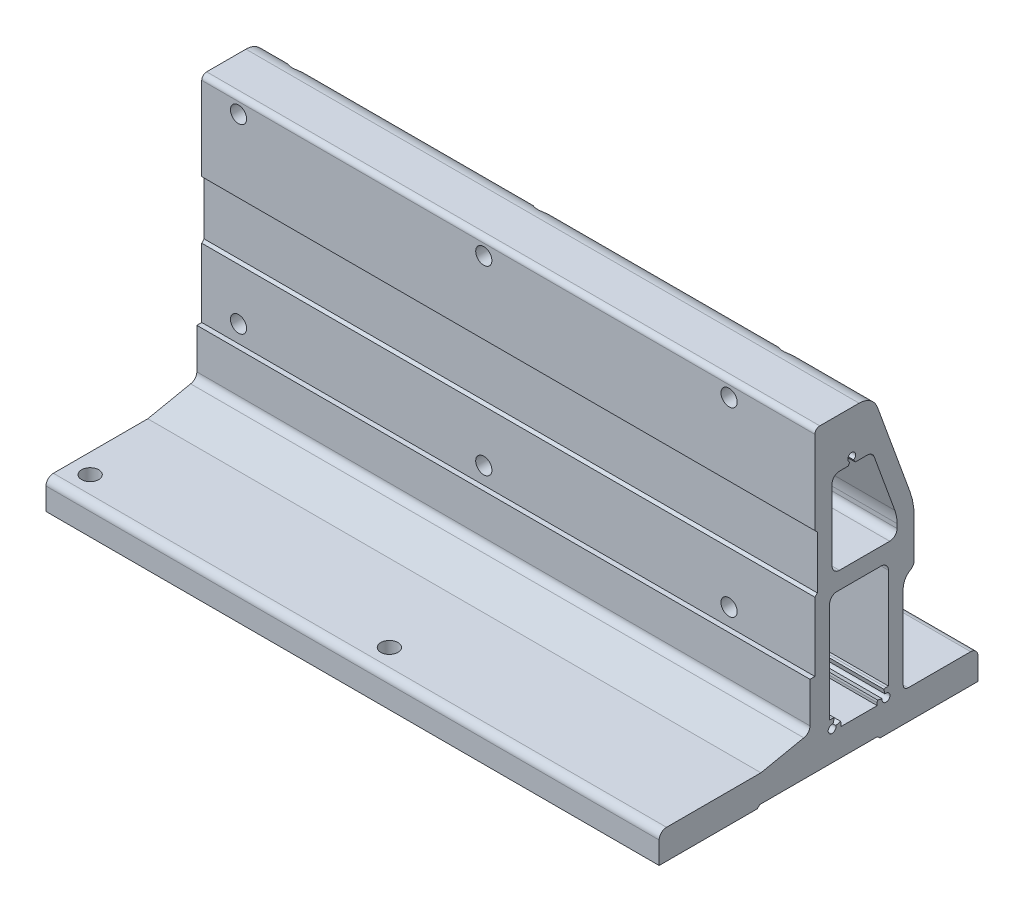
from build123d import *

# Parameters (mm, degrees)
EXTRUDE_1_DEPTH              = 125
HOLE_WIZARD_M6_1_D           = 6.6
HOLE_WIZARD_M6_1_CBORE_D     = 11
HOLE_WIZARD_M6_1_CBORE_DEPTH = 34.5
PATTERN_LINEAR_1_COUNT       = 3
PATTERN_LINEAR_1_PITCH       = 100
HOLE_WIZARD_M4_1_D           = 3.3
HOLE_WIZARD_M4_1_DEPTH       = 10
HOLE_WIZARD_M4_1_TIP         = 0.991420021
F_5_0MM_1_D                  = 5
F_5_0MM_1_DEPTH              = 10
F_5_0MM_1_TIP                = 1.502151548
HOLE_WIZARD_7_0_7_1_D        = 7


with BuildPart() as part:
    # Sketch 1 → Extrude 1 (new, symmetric)
    with BuildSketch(Plane(origin=(0, 0, 0), x_dir=(0, 0, -1), z_dir=(1, 0, 0))):
        with BuildLine():
            Line((-1.5, 85.5), (-1.5, 119.5))
            ThreePointArc((-1.5, 119.5), (-0.914213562, 120.914213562), (0.5, 121.5))
            Line((0.5, 121.5), (16.514163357, 121.5))
            ThreePointArc((16.514163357, 121.5), (21.102774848, 120.053216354), (24.031704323, 116.236161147))
            Line((24.031704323, 116.236161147), (37.190778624, 80.081901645))
            ThreePointArc((37.190778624, 80.081901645), (38.54423259, 75.030742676), (39, 69.821297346))
            Line((39, 69.821297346), (39, 54.794228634))
            ThreePointArc((39, 54.794228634), (38.598076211, 53.294228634), (37.5, 52.196152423))
            ThreePointArc((37.5, 52.196152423), (35.303847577, 50), (34.5, 47))
            Line((34.5, 47), (34.5, 13))
            ThreePointArc((34.5, 13), (35.085786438, 11.585786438), (36.5, 11))
            Line((36.5, 11), (62, 11))
            ThreePointArc((62, 11), (64.121320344, 10.121320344), (65, 8))
            Line((65, 8), (65, -1))
            Line((65, -1), (25, -1))
            Line((25, -1), (24, 0))
            Line((24, 0), (-24, 0))
            Line((-24, 0), (-25, -1))
            Line((-25, -1), (-65, -1))
            Line((-65, -1), (-65, 8))
            ThreePointArc((-65, 8), (-64.121320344, 10.121320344), (-62, 11))
            Line((-62, 11), (-23.5, 11))
            Line((-23.5, 11), (-6.035096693, 14.602337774))
            ThreePointArc((-6.035096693, 14.602337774), (-4.220229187, 15.616059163), (-3.5, 17.566096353))
            Line((-3.5, 17.566096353), (-3.5, 34))
            Line((-3.5, 34), (-1.5, 34))
            Line((-1.5, 34), (-1.5, 62))
            Line((-1.5, 62), (-0.5, 63))
            Line((-0.5, 63), (-0.5, 84.5))
            Line((-0.5, 84.5), (-1.5, 85.5))
        make_face()
        with BuildLine():
            Line((22.664439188, 99.52606043), (31.095389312, 76.362215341))
            ThreePointArc((31.095389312, 76.362215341), (31.772116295, 73.836635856), (32, 71.231913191))
            Line((32, 71.231913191), (32, 69.5))
            ThreePointArc((32, 69.5), (31.121320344, 67.378679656), (29, 66.5))
            Line((29, 66.5), (8.5, 66.5))
            ThreePointArc((8.5, 66.5), (6.378679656, 67.378679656), (5.5, 69.5))
            Line((5.5, 69.5), (5.5, 98.5))
            ThreePointArc((5.5, 98.5), (6.378679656, 100.621320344), (8.5, 101.5))
            Line((8.5, 101.5), (12.056626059, 101.5))
            Line((12.056626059, 101.5), (12.7, 102.614356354))
            ThreePointArc((12.7, 102.614356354), (13.5, 105.599997), (14.3, 102.614356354))
            Line((14.3, 102.614356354), (14.943373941, 101.5))
            Line((14.943373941, 101.5), (19.845361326, 101.5))
            ThreePointArc((19.845361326, 101.5), (21.566090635, 100.957456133), (22.664439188, 99.52606043))
        make_face(mode=Mode.SUBTRACT)
        with BuildLine():
            Line((28.5, 15.6), (28.5, 56.5))
            ThreePointArc((28.5, 56.5), (27.621320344, 58.621320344), (25.5, 59.5))
            Line((25.5, 59.5), (7.5, 59.5))
            ThreePointArc((7.5, 59.5), (5.378679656, 58.621320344), (4.5, 56.5))
            Line((4.5, 56.5), (4.5, 15.6))
            Line((4.5, 15.6), (5.5, 15.6))
            ThreePointArc((5.5, 15.6), (5.969894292, 15.569201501), (6.431748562, 15.477332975))
            Line((6.431748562, 15.477332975), (5.914110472, 13.545481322))
            ThreePointArc((5.914110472, 13.545481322), (4.36862915, 10.86862915), (7.045481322, 12.414110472))
            Line((7.045481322, 12.414110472), (8.977332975, 12.931748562))
            ThreePointArc((8.977332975, 12.931748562), (9.069201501, 12.469894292), (9.1, 12))
            Line((9.1, 12), (9.1, 11))
            Line((9.1, 11), (23.9, 11))
            Line((23.9, 11), (23.9, 12))
            ThreePointArc((23.9, 12), (23.930798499, 12.469894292), (24.022667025, 12.931748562))
            Line((24.022667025, 12.931748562), (25.954518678, 12.414110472))
            ThreePointArc((25.954518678, 12.414110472), (28.63137085, 10.86862915), (27.085889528, 13.545481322))
            Line((27.085889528, 13.545481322), (26.568251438, 15.477332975))
            ThreePointArc((26.568251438, 15.477332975), (27.030105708, 15.569201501), (27.5, 15.6))
            Line((27.5, 15.6), (28.5, 15.6))
        make_face(mode=Mode.SUBTRACT)
    extrude(amount=EXTRUDE_1_DEPTH, both=True)

    # Hole Wizard M6 _ _ _ _ _1 (through all)
    with Locations(Plane(origin=(0, 0, -39), x_dir=(-1, 0, 0), z_dir=(0, 0, -1))):
        with Locations((-90, 115), (-90, 41)):
            hole_wizard_m6_1 = CounterBoreHole(HOLE_WIZARD_M6_1_D / 2, HOLE_WIZARD_M6_1_CBORE_D / 2, HOLE_WIZARD_M6_1_CBORE_DEPTH)

    # Pattern Linear 1: Hole Wizard M6 _ _ _ _ _1 ×3
    with Locations(*[(-i * PATTERN_LINEAR_1_PITCH, 0, 0) for i in range(1, PATTERN_LINEAR_1_COUNT)]):
        add(hole_wizard_m6_1, mode=Mode.SUBTRACT)

    # Hole Wizard M4 _ _1
    with Locations(Plane.ZY.offset(125)):
        with Locations((-37, 5), (-9, 5)):
            Hole(HOLE_WIZARD_M4_1_D / 2, depth=HOLE_WIZARD_M4_1_DEPTH)
            with Locations((0, 0, -(HOLE_WIZARD_M4_1_DEPTH + HOLE_WIZARD_M4_1_TIP / 2))):  # 118° drill point
                Cone(0, HOLE_WIZARD_M4_1_D / 2, HOLE_WIZARD_M4_1_TIP, mode=Mode.SUBTRACT)

    # 5.0mm _ _1
    with Locations(Plane(origin=(0, 0, 0), x_dir=(-1, 0, 0), z_dir=(0, -1, 0))):
        with Locations((-5, 0), (117, 0)):
            Hole(F_5_0MM_1_D / 2, depth=F_5_0MM_1_DEPTH)
            with Locations((0, 0, -(F_5_0MM_1_DEPTH + F_5_0MM_1_TIP / 2))):  # 118° drill point
                Cone(0, F_5_0MM_1_D / 2, F_5_0MM_1_TIP, mode=Mode.SUBTRACT)

    # Hole Wizard 7.0 _7_ _ _1 (through all)
    with Locations(Plane(origin=(0, -1, 0), x_dir=(-1, 0, 0), z_dir=(0, -1, 0))):
        with Locations((117, -55), (-5, -55), (117, 55), (-5, 55)):
            Hole(HOLE_WIZARD_7_0_7_1_D / 2)


solid = part.part
